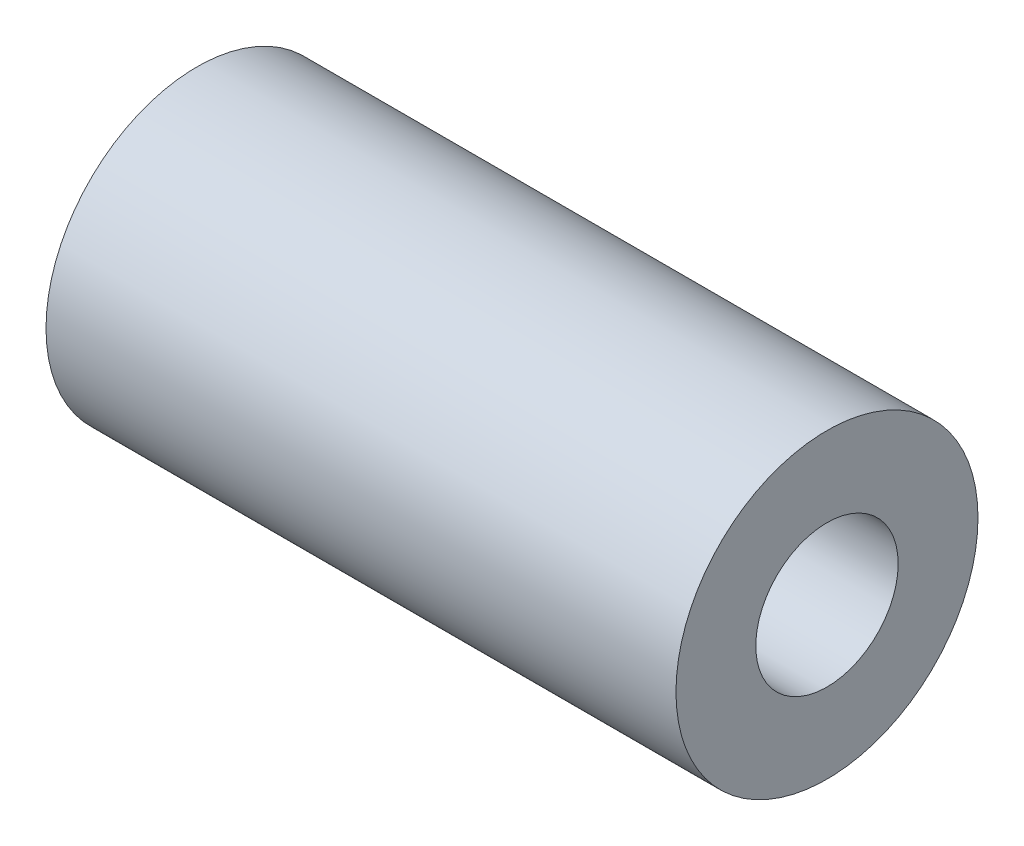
ISO-10303-21;
HEADER;
FILE_DESCRIPTION(('STEP AP214'),'2;1');
FILE_NAME('part.step','',(''),(''),'','','');
FILE_SCHEMA(('AUTOMOTIVE_DESIGN { 1 0 10303 214 1 1 1 1 }'));
ENDSEC;
DATA;
#1=APPLICATION_CONTEXT('core data for automotive mechanical design processes');
#2=APPLICATION_PROTOCOL_DEFINITION('international standard','automotive_design',2000,#1);
#3=PRODUCT_CONTEXT('',#1,'mechanical');
#4=PRODUCT('Part','Part','',(#3));
#5=PRODUCT_RELATED_PRODUCT_CATEGORY('part','',(#4));
#6=PRODUCT_DEFINITION_FORMATION('','',#4);
#7=PRODUCT_DEFINITION_CONTEXT('part definition',#1,'design');
#8=PRODUCT_DEFINITION('design','',#6,#7);
#9=PRODUCT_DEFINITION_SHAPE('','',#8);
#10=(LENGTH_UNIT() NAMED_UNIT(*) SI_UNIT(.MILLI.,.METRE.));
#11=(NAMED_UNIT(*) PLANE_ANGLE_UNIT() SI_UNIT($,.RADIAN.));
#12=(NAMED_UNIT(*) SI_UNIT($,.STERADIAN.) SOLID_ANGLE_UNIT());
#13=UNCERTAINTY_MEASURE_WITH_UNIT(LENGTH_MEASURE(1.E-05),#10,'distance_accuracy_value','');
#14=(GEOMETRIC_REPRESENTATION_CONTEXT(3) GLOBAL_UNCERTAINTY_ASSIGNED_CONTEXT((#13)) GLOBAL_UNIT_ASSIGNED_CONTEXT((#10,
#11,#12)) REPRESENTATION_CONTEXT('',''));
#15=CARTESIAN_POINT('',(0.,0.,0.));
#16=DIRECTION('',(0.,0.,1.));
#17=DIRECTION('',(1.,0.,0.));
#18=AXIS2_PLACEMENT_3D('',#15,#16,#17);
#19=CARTESIAN_POINT('',(14.6,0.,0.));
#20=DIRECTION('',(1.,0.,0.));
#21=DIRECTION('',(0.,0.,-1.));
#22=AXIS2_PLACEMENT_3D('',#19,#20,#21);
#23=PLANE('',#22);
#24=CARTESIAN_POINT('',(14.6,0.,0.));
#25=DIRECTION('',(1.,0.,0.));
#26=DIRECTION('',(0.,0.,-1.));
#27=AXIS2_PLACEMENT_3D('',#24,#25,#26);
#28=CIRCLE('',#27,3.5);
#29=CARTESIAN_POINT('',(14.6,0.,-3.5));
#30=VERTEX_POINT('',#29);
#31=EDGE_CURVE('E10',#30,#30,#28,.T.);
#32=ORIENTED_EDGE('',*,*,#31,.T.);
#33=EDGE_LOOP('',(#32));
#34=FACE_BOUND('',#33,.T.);
#35=CARTESIAN_POINT('',(14.6,0.,0.));
#36=DIRECTION('',(1.,0.,0.));
#37=DIRECTION('',(0.,0.,-1.));
#38=AXIS2_PLACEMENT_3D('',#35,#36,#37);
#39=CIRCLE('',#38,1.65);
#40=CARTESIAN_POINT('',(14.6,0.,-1.65));
#41=VERTEX_POINT('',#40);
#42=EDGE_CURVE('E54',#41,#41,#39,.T.);
#43=ORIENTED_EDGE('',*,*,#42,.F.);
#44=EDGE_LOOP('',(#43));
#45=FACE_BOUND('',#44,.T.);
#46=ADVANCED_FACE('F41',(#34,#45),#23,.T.);
#47=CARTESIAN_POINT('',(0.,0.,0.));
#48=DIRECTION('',(1.,0.,0.));
#49=DIRECTION('',(0.,0.,-1.));
#50=AXIS2_PLACEMENT_3D('',#47,#48,#49);
#51=PLANE('',#50);
#52=CARTESIAN_POINT('',(0.,0.,0.));
#53=DIRECTION('',(1.,0.,0.));
#54=DIRECTION('',(0.,0.,-1.));
#55=AXIS2_PLACEMENT_3D('',#52,#53,#54);
#56=CIRCLE('',#55,3.5);
#57=CARTESIAN_POINT('',(0.,0.,-3.5));
#58=VERTEX_POINT('',#57);
#59=EDGE_CURVE('E45',#58,#58,#56,.T.);
#60=ORIENTED_EDGE('',*,*,#59,.F.);
#61=EDGE_LOOP('',(#60));
#62=FACE_BOUND('',#61,.T.);
#63=CARTESIAN_POINT('',(0.,0.,0.));
#64=DIRECTION('',(1.,0.,0.));
#65=DIRECTION('',(0.,0.,-1.));
#66=AXIS2_PLACEMENT_3D('',#63,#64,#65);
#67=CIRCLE('',#66,1.65);
#68=CARTESIAN_POINT('',(0.,0.,-1.65));
#69=VERTEX_POINT('',#68);
#70=EDGE_CURVE('E56',#69,#69,#67,.T.);
#71=ORIENTED_EDGE('',*,*,#70,.T.);
#72=EDGE_LOOP('',(#71));
#73=FACE_BOUND('',#72,.T.);
#74=ADVANCED_FACE('F68',(#62,#73),#51,.F.);
#75=CARTESIAN_POINT('',(14.6,0.,0.));
#76=DIRECTION('',(-1.,0.,0.));
#77=DIRECTION('',(0.,0.,1.));
#78=AXIS2_PLACEMENT_3D('',#75,#76,#77);
#79=CYLINDRICAL_SURFACE('',#78,3.5);
#80=ORIENTED_EDGE('',*,*,#31,.F.);
#81=EDGE_LOOP('',(#80));
#82=FACE_BOUND('',#81,.T.);
#83=ORIENTED_EDGE('',*,*,#59,.T.);
#84=EDGE_LOOP('',(#83));
#85=FACE_BOUND('',#84,.T.);
#86=ADVANCED_FACE('F43',(#82,#85),#79,.T.);
#87=CARTESIAN_POINT('',(14.6,0.,0.));
#88=DIRECTION('',(-1.,0.,0.));
#89=DIRECTION('',(0.,0.,1.));
#90=AXIS2_PLACEMENT_3D('',#87,#88,#89);
#91=CYLINDRICAL_SURFACE('',#90,1.65);
#92=ORIENTED_EDGE('',*,*,#42,.T.);
#93=EDGE_LOOP('',(#92));
#94=FACE_BOUND('',#93,.T.);
#95=ORIENTED_EDGE('',*,*,#70,.F.);
#96=EDGE_LOOP('',(#95));
#97=FACE_BOUND('',#96,.T.);
#98=ADVANCED_FACE('F64',(#94,#97),#91,.F.);
#99=CLOSED_SHELL('',(#46,#74,#86,#98));
#100=MANIFOLD_SOLID_BREP('B2',#99);
#101=ADVANCED_BREP_SHAPE_REPRESENTATION('',(#18,#100),#14);
#102=SHAPE_DEFINITION_REPRESENTATION(#9,#101);
ENDSEC;
END-ISO-10303-21;
